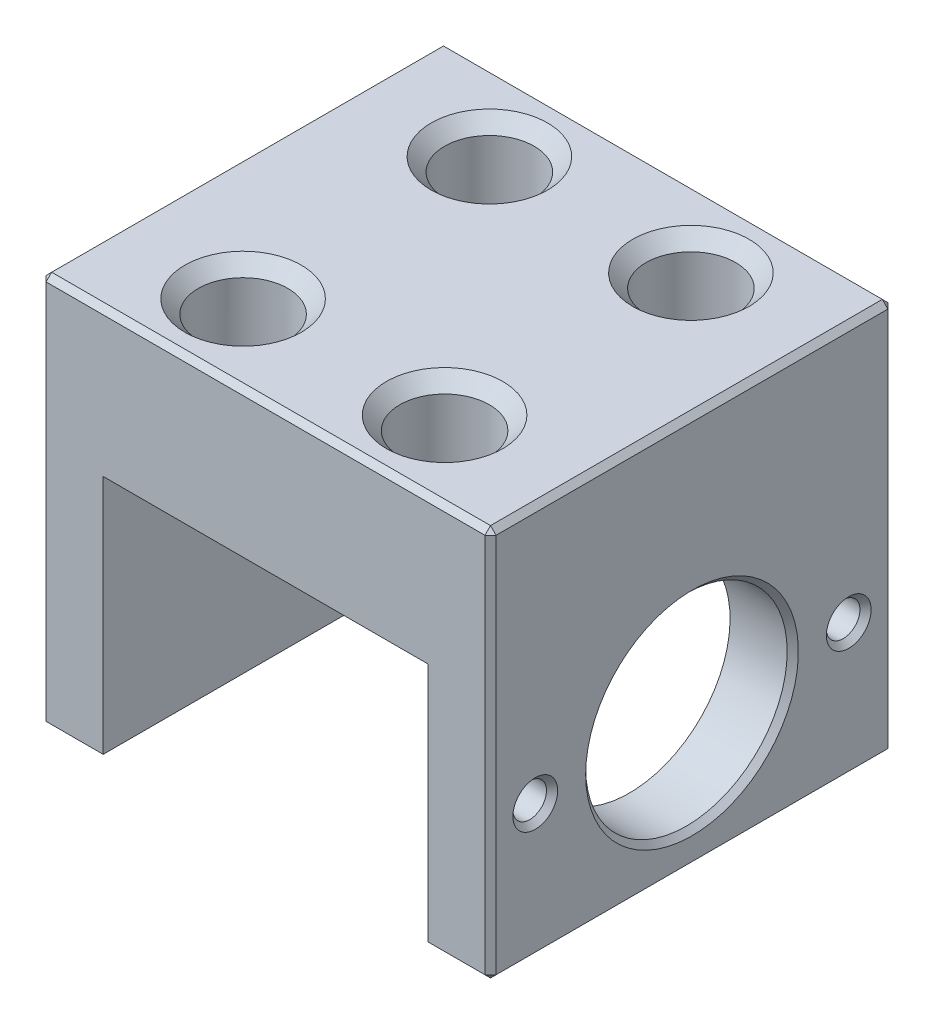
ISO-10303-21;
HEADER;
FILE_DESCRIPTION(('STEP AP214'),'2;1');
FILE_NAME('part.step','',(''),(''),'','','');
FILE_SCHEMA(('AUTOMOTIVE_DESIGN { 1 0 10303 214 1 1 1 1 }'));
ENDSEC;
DATA;
#1=APPLICATION_CONTEXT('core data for automotive mechanical design processes');
#2=APPLICATION_PROTOCOL_DEFINITION('international standard','automotive_design',2000,#1);
#3=PRODUCT_CONTEXT('',#1,'mechanical');
#4=PRODUCT('Part','Part','',(#3));
#5=PRODUCT_RELATED_PRODUCT_CATEGORY('part','',(#4));
#6=PRODUCT_DEFINITION_FORMATION('','',#4);
#7=PRODUCT_DEFINITION_CONTEXT('part definition',#1,'design');
#8=PRODUCT_DEFINITION('design','',#6,#7);
#9=PRODUCT_DEFINITION_SHAPE('','',#8);
#10=(LENGTH_UNIT() NAMED_UNIT(*) SI_UNIT(.MILLI.,.METRE.));
#11=(NAMED_UNIT(*) PLANE_ANGLE_UNIT() SI_UNIT($,.RADIAN.));
#12=(NAMED_UNIT(*) SI_UNIT($,.STERADIAN.) SOLID_ANGLE_UNIT());
#13=UNCERTAINTY_MEASURE_WITH_UNIT(LENGTH_MEASURE(1.E-05),#10,'distance_accuracy_value','');
#14=(GEOMETRIC_REPRESENTATION_CONTEXT(3) GLOBAL_UNCERTAINTY_ASSIGNED_CONTEXT((#13)) GLOBAL_UNIT_ASSIGNED_CONTEXT((#10,
#11,#12)) REPRESENTATION_CONTEXT('',''));
#15=CARTESIAN_POINT('',(0.,0.,0.));
#16=DIRECTION('',(0.,0.,1.));
#17=DIRECTION('',(1.,0.,0.));
#18=AXIS2_PLACEMENT_3D('',#15,#16,#17);
#19=CARTESIAN_POINT('',(20.1,0.,18.));
#20=DIRECTION('',(-1.,0.,0.));
#21=DIRECTION('',(0.,0.,1.));
#22=AXIS2_PLACEMENT_3D('',#19,#20,#21);
#23=PLANE('',#22);
#24=CARTESIAN_POINT('',(20.1,-23.,0.));
#25=DIRECTION('',(-1.,0.,0.));
#26=DIRECTION('',(0.,0.,1.));
#27=AXIS2_PLACEMENT_3D('',#24,#25,#26);
#28=CIRCLE('',#27,9.5);
#29=CARTESIAN_POINT('',(20.1,-23.,9.5));
#30=VERTEX_POINT('',#29);
#31=EDGE_CURVE('E208',#30,#30,#28,.T.);
#32=ORIENTED_EDGE('',*,*,#31,.T.);
#33=EDGE_LOOP('',(#32));
#34=FACE_BOUND('',#33,.T.);
#35=DIRECTION('',(0.,-1.,0.));
#36=VECTOR('',#35,1.);
#37=CARTESIAN_POINT('',(20.1,0.,17.5));
#38=LINE('',#37,#36);
#39=CARTESIAN_POINT('',(20.1,-0.5,17.5));
#40=VERTEX_POINT('',#39);
#41=CARTESIAN_POINT('',(20.1,-34.5,17.5));
#42=VERTEX_POINT('',#41);
#43=EDGE_CURVE('E199',#40,#42,#38,.T.);
#44=ORIENTED_EDGE('',*,*,#43,.T.);
#45=DIRECTION('',(0.,0.,-1.));
#46=VECTOR('',#45,1.);
#47=CARTESIAN_POINT('',(20.1,-34.5,18.));
#48=LINE('',#47,#46);
#49=CARTESIAN_POINT('',(20.1,-34.5,-17.5));
#50=VERTEX_POINT('',#49);
#51=EDGE_CURVE('E205',#42,#50,#48,.T.);
#52=ORIENTED_EDGE('',*,*,#51,.T.);
#53=DIRECTION('',(0.,1.,0.));
#54=VECTOR('',#53,1.);
#55=CARTESIAN_POINT('',(20.1,0.,-17.5));
#56=LINE('',#55,#54);
#57=CARTESIAN_POINT('',(20.1,-0.5,-17.5));
#58=VERTEX_POINT('',#57);
#59=EDGE_CURVE('E203',#50,#58,#56,.T.);
#60=ORIENTED_EDGE('',*,*,#59,.T.);
#61=DIRECTION('',(0.,0.,1.));
#62=VECTOR('',#61,1.);
#63=CARTESIAN_POINT('',(20.1,-0.5,18.));
#64=LINE('',#63,#62);
#65=EDGE_CURVE('E201',#58,#40,#64,.T.);
#66=ORIENTED_EDGE('',*,*,#65,.T.);
#67=EDGE_LOOP('',(#44,#52,#60,#66));
#68=FACE_BOUND('',#67,.T.);
#69=CARTESIAN_POINT('',(20.1,-23.,14.));
#70=DIRECTION('',(1.,0.,0.));
#71=DIRECTION('',(0.,0.,-1.));
#72=AXIS2_PLACEMENT_3D('',#69,#70,#71);
#73=CIRCLE('',#72,2.);
#74=CARTESIAN_POINT('',(20.1,-23.,12.));
#75=VERTEX_POINT('',#74);
#76=EDGE_CURVE('E715',#75,#75,#73,.T.);
#77=ORIENTED_EDGE('',*,*,#76,.F.);
#78=EDGE_LOOP('',(#77));
#79=FACE_BOUND('',#78,.T.);
#80=CARTESIAN_POINT('',(20.1,-23.,-14.));
#81=DIRECTION('',(1.,0.,0.));
#82=DIRECTION('',(0.,0.,-1.));
#83=AXIS2_PLACEMENT_3D('',#80,#81,#82);
#84=CIRCLE('',#83,2.);
#85=CARTESIAN_POINT('',(20.1,-23.,-16.));
#86=VERTEX_POINT('',#85);
#87=EDGE_CURVE('E707',#86,#86,#84,.T.);
#88=ORIENTED_EDGE('',*,*,#87,.F.);
#89=EDGE_LOOP('',(#88));
#90=FACE_BOUND('',#89,.T.);
#91=ADVANCED_FACE('F15',(#34,#68,#79,#90),#23,.F.);
#92=CARTESIAN_POINT('',(20.1,-35.,18.));
#93=DIRECTION('',(0.,1.,0.));
#94=DIRECTION('',(-1.,0.,0.));
#95=AXIS2_PLACEMENT_3D('',#92,#93,#94);
#96=PLANE('',#95);
#97=DIRECTION('',(-1.,0.,0.));
#98=VECTOR('',#97,1.);
#99=CARTESIAN_POINT('',(20.1,-35.,17.5));
#100=LINE('',#99,#98);
#101=CARTESIAN_POINT('',(19.6,-35.,17.5));
#102=VERTEX_POINT('',#101);
#103=CARTESIAN_POINT('',(15.,-35.,17.5));
#104=VERTEX_POINT('',#103);
#105=EDGE_CURVE('E213',#102,#104,#100,.T.);
#106=ORIENTED_EDGE('',*,*,#105,.T.);
#107=DIRECTION('',(0.,0.,-1.));
#108=VECTOR('',#107,1.);
#109=CARTESIAN_POINT('',(15.,-35.,18.));
#110=LINE('',#109,#108);
#111=CARTESIAN_POINT('',(15.,-35.,-17.5));
#112=VERTEX_POINT('',#111);
#113=EDGE_CURVE('E217',#104,#112,#110,.T.);
#114=ORIENTED_EDGE('',*,*,#113,.T.);
#115=DIRECTION('',(1.,0.,0.));
#116=VECTOR('',#115,1.);
#117=CARTESIAN_POINT('',(20.1,-35.,-17.5));
#118=LINE('',#117,#116);
#119=CARTESIAN_POINT('',(19.6,-35.,-17.5));
#120=VERTEX_POINT('',#119);
#121=EDGE_CURVE('E215',#112,#120,#118,.T.);
#122=ORIENTED_EDGE('',*,*,#121,.T.);
#123=DIRECTION('',(0.,0.,1.));
#124=VECTOR('',#123,1.);
#125=CARTESIAN_POINT('',(19.6,-35.,18.));
#126=LINE('',#125,#124);
#127=EDGE_CURVE('E211',#120,#102,#126,.T.);
#128=ORIENTED_EDGE('',*,*,#127,.T.);
#129=EDGE_LOOP('',(#106,#114,#122,#128));
#130=FACE_BOUND('',#129,.T.);
#131=ADVANCED_FACE('F385',(#130),#96,.F.);
#132=CARTESIAN_POINT('',(-20.1,0.,18.));
#133=DIRECTION('',(0.,-1.,0.));
#134=DIRECTION('',(1.,0.,0.));
#135=AXIS2_PLACEMENT_3D('',#132,#133,#134);
#136=PLANE('',#135);
#137=DIRECTION('',(-1.,0.,0.));
#138=VECTOR('',#137,1.);
#139=CARTESIAN_POINT('',(-20.1,0.,-17.5));
#140=LINE('',#139,#138);
#141=CARTESIAN_POINT('',(19.6,0.,-17.5));
#142=VERTEX_POINT('',#141);
#143=CARTESIAN_POINT('',(-19.6,0.,-17.5));
#144=VERTEX_POINT('',#143);
#145=EDGE_CURVE('E245',#142,#144,#140,.T.);
#146=ORIENTED_EDGE('',*,*,#145,.T.);
#147=DIRECTION('',(0.,0.,1.));
#148=VECTOR('',#147,1.);
#149=CARTESIAN_POINT('',(-19.6,0.,18.));
#150=LINE('',#149,#148);
#151=CARTESIAN_POINT('',(-19.6,0.,17.5));
#152=VERTEX_POINT('',#151);
#153=EDGE_CURVE('E249',#144,#152,#150,.T.);
#154=ORIENTED_EDGE('',*,*,#153,.T.);
#155=DIRECTION('',(1.,0.,0.));
#156=VECTOR('',#155,1.);
#157=CARTESIAN_POINT('',(-20.1,0.,17.5));
#158=LINE('',#157,#156);
#159=CARTESIAN_POINT('',(19.6,0.,17.5));
#160=VERTEX_POINT('',#159);
#161=EDGE_CURVE('E247',#152,#160,#158,.T.);
#162=ORIENTED_EDGE('',*,*,#161,.T.);
#163=DIRECTION('',(0.,0.,-1.));
#164=VECTOR('',#163,1.);
#165=CARTESIAN_POINT('',(19.6,0.,18.));
#166=LINE('',#165,#164);
#167=EDGE_CURVE('E243',#160,#142,#166,.T.);
#168=ORIENTED_EDGE('',*,*,#167,.T.);
#169=EDGE_LOOP('',(#146,#154,#162,#168));
#170=FACE_BOUND('',#169,.T.);
#171=CARTESIAN_POINT('',(9.,0.,-11.));
#172=DIRECTION('',(0.,1.,0.));
#173=DIRECTION('',(0.,0.,1.));
#174=AXIS2_PLACEMENT_3D('',#171,#172,#173);
#175=CIRCLE('',#174,5.2);
#176=CARTESIAN_POINT('',(9.,0.,-5.8));
#177=VERTEX_POINT('',#176);
#178=EDGE_CURVE('E348',#177,#177,#175,.T.);
#179=ORIENTED_EDGE('',*,*,#178,.F.);
#180=EDGE_LOOP('',(#179));
#181=FACE_BOUND('',#180,.T.);
#182=CARTESIAN_POINT('',(-9.,0.,-11.));
#183=DIRECTION('',(0.,1.,0.));
#184=DIRECTION('',(0.,0.,1.));
#185=AXIS2_PLACEMENT_3D('',#182,#183,#184);
#186=CIRCLE('',#185,5.2);
#187=CARTESIAN_POINT('',(-9.,0.,-5.8));
#188=VERTEX_POINT('',#187);
#189=EDGE_CURVE('E195',#188,#188,#186,.T.);
#190=ORIENTED_EDGE('',*,*,#189,.F.);
#191=EDGE_LOOP('',(#190));
#192=FACE_BOUND('',#191,.T.);
#193=CARTESIAN_POINT('',(-9.,0.,11.));
#194=DIRECTION('',(0.,1.,0.));
#195=DIRECTION('',(0.,0.,1.));
#196=AXIS2_PLACEMENT_3D('',#193,#194,#195);
#197=CIRCLE('',#196,5.2);
#198=CARTESIAN_POINT('',(-9.,0.,16.2));
#199=VERTEX_POINT('',#198);
#200=EDGE_CURVE('E190',#199,#199,#197,.T.);
#201=ORIENTED_EDGE('',*,*,#200,.F.);
#202=EDGE_LOOP('',(#201));
#203=FACE_BOUND('',#202,.T.);
#204=CARTESIAN_POINT('',(9.,0.,11.));
#205=DIRECTION('',(0.,1.,0.));
#206=DIRECTION('',(0.,0.,1.));
#207=AXIS2_PLACEMENT_3D('',#204,#205,#206);
#208=CIRCLE('',#207,5.2);
#209=CARTESIAN_POINT('',(9.,0.,16.2));
#210=VERTEX_POINT('',#209);
#211=EDGE_CURVE('E185',#210,#210,#208,.T.);
#212=ORIENTED_EDGE('',*,*,#211,.F.);
#213=EDGE_LOOP('',(#212));
#214=FACE_BOUND('',#213,.T.);
#215=ADVANCED_FACE('F382',(#170,#181,#192,#203,#214),#136,.F.);
#216=CARTESIAN_POINT('',(-20.1,0.,18.));
#217=DIRECTION('',(1.,0.,0.));
#218=DIRECTION('',(0.,1.,0.));
#219=AXIS2_PLACEMENT_3D('',#216,#217,#218);
#220=PLANE('',#219);
#221=DIRECTION('',(0.,1.,0.));
#222=VECTOR('',#221,1.);
#223=CARTESIAN_POINT('',(-20.1,0.,17.5));
#224=LINE('',#223,#222);
#225=CARTESIAN_POINT('',(-20.1,-34.5,17.5));
#226=VERTEX_POINT('',#225);
#227=CARTESIAN_POINT('',(-20.1,-0.5,17.5));
#228=VERTEX_POINT('',#227);
#229=EDGE_CURVE('E238',#226,#228,#224,.T.);
#230=ORIENTED_EDGE('',*,*,#229,.T.);
#231=DIRECTION('',(0.,0.,-1.));
#232=VECTOR('',#231,1.);
#233=CARTESIAN_POINT('',(-20.1,-0.5,18.));
#234=LINE('',#233,#232);
#235=CARTESIAN_POINT('',(-20.1,-0.5,-17.5));
#236=VERTEX_POINT('',#235);
#237=EDGE_CURVE('E240',#228,#236,#234,.T.);
#238=ORIENTED_EDGE('',*,*,#237,.T.);
#239=DIRECTION('',(0.,-1.,0.));
#240=VECTOR('',#239,1.);
#241=CARTESIAN_POINT('',(-20.1,-35.,-17.5));
#242=LINE('',#241,#240);
#243=CARTESIAN_POINT('',(-20.1,-34.5,-17.5));
#244=VERTEX_POINT('',#243);
#245=EDGE_CURVE('E234',#236,#244,#242,.T.);
#246=ORIENTED_EDGE('',*,*,#245,.T.);
#247=DIRECTION('',(0.,0.,1.));
#248=VECTOR('',#247,1.);
#249=CARTESIAN_POINT('',(-20.1,-34.5,18.));
#250=LINE('',#249,#248);
#251=EDGE_CURVE('E236',#244,#226,#250,.T.);
#252=ORIENTED_EDGE('',*,*,#251,.T.);
#253=EDGE_LOOP('',(#230,#238,#246,#252));
#254=FACE_BOUND('',#253,.T.);
#255=ADVANCED_FACE('F384',(#254),#220,.F.);
#256=CARTESIAN_POINT('',(-20.1,-35.,18.));
#257=DIRECTION('',(0.,1.,0.));
#258=DIRECTION('',(-1.,0.,0.));
#259=AXIS2_PLACEMENT_3D('',#256,#257,#258);
#260=PLANE('',#259);
#261=DIRECTION('',(1.,0.,0.));
#262=VECTOR('',#261,1.);
#263=CARTESIAN_POINT('',(-14.5,-35.,-17.5));
#264=LINE('',#263,#262);
#265=CARTESIAN_POINT('',(-19.6,-35.,-17.5));
#266=VERTEX_POINT('',#265);
#267=CARTESIAN_POINT('',(-15.,-35.,-17.5));
#268=VERTEX_POINT('',#267);
#269=EDGE_CURVE('E225',#266,#268,#264,.T.);
#270=ORIENTED_EDGE('',*,*,#269,.T.);
#271=DIRECTION('',(0.,0.,1.));
#272=VECTOR('',#271,1.);
#273=CARTESIAN_POINT('',(-15.,-35.,18.));
#274=LINE('',#273,#272);
#275=CARTESIAN_POINT('',(-15.,-35.,17.5));
#276=VERTEX_POINT('',#275);
#277=EDGE_CURVE('E231',#268,#276,#274,.T.);
#278=ORIENTED_EDGE('',*,*,#277,.T.);
#279=DIRECTION('',(-1.,0.,0.));
#280=VECTOR('',#279,1.);
#281=CARTESIAN_POINT('',(-20.1,-35.,17.5));
#282=LINE('',#281,#280);
#283=CARTESIAN_POINT('',(-19.6,-35.,17.5));
#284=VERTEX_POINT('',#283);
#285=EDGE_CURVE('E229',#276,#284,#282,.T.);
#286=ORIENTED_EDGE('',*,*,#285,.T.);
#287=DIRECTION('',(0.,0.,-1.));
#288=VECTOR('',#287,1.);
#289=CARTESIAN_POINT('',(-19.6,-35.,18.));
#290=LINE('',#289,#288);
#291=EDGE_CURVE('E227',#284,#266,#290,.T.);
#292=ORIENTED_EDGE('',*,*,#291,.T.);
#293=EDGE_LOOP('',(#270,#278,#286,#292));
#294=FACE_BOUND('',#293,.T.);
#295=ADVANCED_FACE('F394',(#294),#260,.F.);
#296=CARTESIAN_POINT('',(-14.5,-35.,18.));
#297=DIRECTION('',(-1.,0.,0.));
#298=DIRECTION('',(0.,-1.,0.));
#299=AXIS2_PLACEMENT_3D('',#296,#297,#298);
#300=PLANE('',#299);
#301=DIRECTION('',(0.,1.,0.));
#302=VECTOR('',#301,1.);
#303=CARTESIAN_POINT('',(-14.5,-35.,18.));
#304=LINE('',#303,#302);
#305=CARTESIAN_POINT('',(-14.5,-34.5,18.));
#306=VERTEX_POINT('',#305);
#307=CARTESIAN_POINT('',(-14.5,-13.,18.));
#308=VERTEX_POINT('',#307);
#309=EDGE_CURVE('E139',#306,#308,#304,.T.);
#310=ORIENTED_EDGE('',*,*,#309,.F.);
#311=DIRECTION('',(0.,0.,-1.));
#312=VECTOR('',#311,1.);
#313=CARTESIAN_POINT('',(-14.5,-34.5,18.));
#314=LINE('',#313,#312);
#315=CARTESIAN_POINT('',(-14.5,-34.5,-18.));
#316=VERTEX_POINT('',#315);
#317=EDGE_CURVE('E223',#306,#316,#314,.T.);
#318=ORIENTED_EDGE('',*,*,#317,.T.);
#319=DIRECTION('',(0.,1.,0.));
#320=VECTOR('',#319,1.);
#321=CARTESIAN_POINT('',(-14.5,-35.,-18.));
#322=LINE('',#321,#320);
#323=CARTESIAN_POINT('',(-14.5,-13.,-18.));
#324=VERTEX_POINT('',#323);
#325=EDGE_CURVE('E155',#316,#324,#322,.T.);
#326=ORIENTED_EDGE('',*,*,#325,.T.);
#327=DIRECTION('',(0.,0.,-1.));
#328=VECTOR('',#327,1.);
#329=CARTESIAN_POINT('',(-14.5,-13.,18.));
#330=LINE('',#329,#328);
#331=EDGE_CURVE('E153',#308,#324,#330,.T.);
#332=ORIENTED_EDGE('',*,*,#331,.F.);
#333=EDGE_LOOP('',(#310,#318,#326,#332));
#334=FACE_BOUND('',#333,.T.);
#335=ADVANCED_FACE('F154',(#334),#300,.F.);
#336=CARTESIAN_POINT('',(14.5,-13.,18.));
#337=DIRECTION('',(0.,1.,0.));
#338=DIRECTION('',(-1.,0.,0.));
#339=AXIS2_PLACEMENT_3D('',#336,#337,#338);
#340=PLANE('',#339);
#341=CARTESIAN_POINT('',(9.,-13.,-11.));
#342=DIRECTION('',(0.,1.,0.));
#343=DIRECTION('',(-1.,0.,0.));
#344=AXIS2_PLACEMENT_3D('',#341,#342,#343);
#345=CIRCLE('',#344,4.);
#346=CARTESIAN_POINT('',(5.,-13.,-11.));
#347=VERTEX_POINT('',#346);
#348=EDGE_CURVE('E192',#347,#347,#345,.T.);
#349=ORIENTED_EDGE('',*,*,#348,.T.);
#350=EDGE_LOOP('',(#349));
#351=FACE_BOUND('',#350,.T.);
#352=CARTESIAN_POINT('',(-9.,-13.,-11.));
#353=DIRECTION('',(0.,1.,0.));
#354=DIRECTION('',(-1.,0.,0.));
#355=AXIS2_PLACEMENT_3D('',#352,#353,#354);
#356=CIRCLE('',#355,4.);
#357=CARTESIAN_POINT('',(-13.,-13.,-11.));
#358=VERTEX_POINT('',#357);
#359=EDGE_CURVE('E187',#358,#358,#356,.T.);
#360=ORIENTED_EDGE('',*,*,#359,.T.);
#361=EDGE_LOOP('',(#360));
#362=FACE_BOUND('',#361,.T.);
#363=CARTESIAN_POINT('',(-9.,-13.,11.));
#364=DIRECTION('',(0.,1.,0.));
#365=DIRECTION('',(-1.,0.,0.));
#366=AXIS2_PLACEMENT_3D('',#363,#364,#365);
#367=CIRCLE('',#366,4.);
#368=CARTESIAN_POINT('',(-13.,-13.,11.));
#369=VERTEX_POINT('',#368);
#370=EDGE_CURVE('E182',#369,#369,#367,.T.);
#371=ORIENTED_EDGE('',*,*,#370,.T.);
#372=EDGE_LOOP('',(#371));
#373=FACE_BOUND('',#372,.T.);
#374=CARTESIAN_POINT('',(9.,-13.,11.));
#375=DIRECTION('',(0.,1.,0.));
#376=DIRECTION('',(-1.,0.,0.));
#377=AXIS2_PLACEMENT_3D('',#374,#375,#376);
#378=CIRCLE('',#377,4.);
#379=CARTESIAN_POINT('',(5.,-13.,11.));
#380=VERTEX_POINT('',#379);
#381=EDGE_CURVE('E178',#380,#380,#378,.T.);
#382=ORIENTED_EDGE('',*,*,#381,.T.);
#383=EDGE_LOOP('',(#382));
#384=FACE_BOUND('',#383,.T.);
#385=DIRECTION('',(1.,0.,0.));
#386=VECTOR('',#385,1.);
#387=CARTESIAN_POINT('',(14.5,-13.,-18.));
#388=LINE('',#387,#386);
#389=CARTESIAN_POINT('',(14.5,-13.,-18.));
#390=VERTEX_POINT('',#389);
#391=EDGE_CURVE('E170',#324,#390,#388,.T.);
#392=ORIENTED_EDGE('',*,*,#391,.T.);
#393=DIRECTION('',(0.,0.,-1.));
#394=VECTOR('',#393,1.);
#395=CARTESIAN_POINT('',(14.5,-13.,18.));
#396=LINE('',#395,#394);
#397=CARTESIAN_POINT('',(14.5,-13.,18.));
#398=VERTEX_POINT('',#397);
#399=EDGE_CURVE('E159',#398,#390,#396,.T.);
#400=ORIENTED_EDGE('',*,*,#399,.F.);
#401=DIRECTION('',(1.,0.,0.));
#402=VECTOR('',#401,1.);
#403=CARTESIAN_POINT('',(14.5,-13.,18.));
#404=LINE('',#403,#402);
#405=EDGE_CURVE('E144',#308,#398,#404,.T.);
#406=ORIENTED_EDGE('',*,*,#405,.F.);
#407=ORIENTED_EDGE('',*,*,#331,.T.);
#408=EDGE_LOOP('',(#392,#400,#406,#407));
#409=FACE_BOUND('',#408,.T.);
#410=ADVANCED_FACE('F161',(#351,#362,#373,#384,#409),#340,.F.);
#411=CARTESIAN_POINT('',(14.5,-35.,18.));
#412=DIRECTION('',(1.,0.,0.));
#413=DIRECTION('',(0.,1.,0.));
#414=AXIS2_PLACEMENT_3D('',#411,#412,#413);
#415=PLANE('',#414);
#416=CARTESIAN_POINT('',(14.5,-23.,-14.));
#417=DIRECTION('',(1.,0.,0.));
#418=DIRECTION('',(0.,1.,0.));
#419=AXIS2_PLACEMENT_3D('',#416,#417,#418);
#420=CIRCLE('',#419,1.5);
#421=CARTESIAN_POINT('',(14.5,-21.5,-14.));
#422=VERTEX_POINT('',#421);
#423=EDGE_CURVE('E710',#422,#422,#420,.T.);
#424=ORIENTED_EDGE('',*,*,#423,.T.);
#425=EDGE_LOOP('',(#424));
#426=FACE_BOUND('',#425,.T.);
#427=CARTESIAN_POINT('',(14.5,-23.,14.));
#428=DIRECTION('',(1.,0.,0.));
#429=DIRECTION('',(0.,1.,0.));
#430=AXIS2_PLACEMENT_3D('',#427,#428,#429);
#431=CIRCLE('',#430,1.5);
#432=CARTESIAN_POINT('',(14.5,-21.5,14.));
#433=VERTEX_POINT('',#432);
#434=EDGE_CURVE('E271',#433,#433,#431,.T.);
#435=ORIENTED_EDGE('',*,*,#434,.T.);
#436=EDGE_LOOP('',(#435));
#437=FACE_BOUND('',#436,.T.);
#438=CARTESIAN_POINT('',(14.5,-23.,0.));
#439=DIRECTION('',(1.,0.,0.));
#440=DIRECTION('',(0.,1.,0.));
#441=AXIS2_PLACEMENT_3D('',#438,#439,#440);
#442=CIRCLE('',#441,9.);
#443=CARTESIAN_POINT('',(14.5,-14.,0.));
#444=VERTEX_POINT('',#443);
#445=EDGE_CURVE('E171',#444,#444,#442,.T.);
#446=ORIENTED_EDGE('',*,*,#445,.T.);
#447=EDGE_LOOP('',(#446));
#448=FACE_BOUND('',#447,.T.);
#449=DIRECTION('',(0.,-1.,0.));
#450=VECTOR('',#449,1.);
#451=CARTESIAN_POINT('',(14.5,-35.,-18.));
#452=LINE('',#451,#450);
#453=CARTESIAN_POINT('',(14.5,-34.5,-18.));
#454=VERTEX_POINT('',#453);
#455=EDGE_CURVE('E150',#390,#454,#452,.T.);
#456=ORIENTED_EDGE('',*,*,#455,.T.);
#457=DIRECTION('',(0.,0.,1.));
#458=VECTOR('',#457,1.);
#459=CARTESIAN_POINT('',(14.5,-34.5,18.));
#460=LINE('',#459,#458);
#461=CARTESIAN_POINT('',(14.5,-34.5,18.));
#462=VERTEX_POINT('',#461);
#463=EDGE_CURVE('E220',#454,#462,#460,.T.);
#464=ORIENTED_EDGE('',*,*,#463,.T.);
#465=DIRECTION('',(0.,-1.,0.));
#466=VECTOR('',#465,1.);
#467=CARTESIAN_POINT('',(14.5,-35.,18.));
#468=LINE('',#467,#466);
#469=EDGE_CURVE('E164',#398,#462,#468,.T.);
#470=ORIENTED_EDGE('',*,*,#469,.F.);
#471=ORIENTED_EDGE('',*,*,#399,.T.);
#472=EDGE_LOOP('',(#456,#464,#470,#471));
#473=FACE_BOUND('',#472,.T.);
#474=ADVANCED_FACE('F608',(#426,#437,#448,#473),#415,.F.);
#475=CARTESIAN_POINT('',(0.,0.,18.));
#476=DIRECTION('',(0.,0.,-1.));
#477=DIRECTION('',(-1.,0.,0.));
#478=AXIS2_PLACEMENT_3D('',#475,#476,#477);
#479=PLANE('',#478);
#480=DIRECTION('',(0.,-1.,0.));
#481=VECTOR('',#480,1.);
#482=CARTESIAN_POINT('',(-19.6,0.,18.));
#483=LINE('',#482,#481);
#484=CARTESIAN_POINT('',(-19.6,-0.5,18.));
#485=VERTEX_POINT('',#484);
#486=CARTESIAN_POINT('',(-19.6,-34.5,18.));
#487=VERTEX_POINT('',#486);
#488=EDGE_CURVE('E258',#485,#487,#483,.T.);
#489=ORIENTED_EDGE('',*,*,#488,.T.);
#490=DIRECTION('',(1.,0.,0.));
#491=VECTOR('',#490,1.);
#492=CARTESIAN_POINT('',(0.,-34.5,18.));
#493=LINE('',#492,#491);
#494=EDGE_CURVE('E147',#487,#306,#493,.T.);
#495=ORIENTED_EDGE('',*,*,#494,.T.);
#496=ORIENTED_EDGE('',*,*,#309,.T.);
#497=ORIENTED_EDGE('',*,*,#405,.T.);
#498=ORIENTED_EDGE('',*,*,#469,.T.);
#499=DIRECTION('',(1.,0.,0.));
#500=VECTOR('',#499,1.);
#501=CARTESIAN_POINT('',(0.,-34.5,18.));
#502=LINE('',#501,#500);
#503=CARTESIAN_POINT('',(19.6,-34.5,18.));
#504=VERTEX_POINT('',#503);
#505=EDGE_CURVE('E254',#462,#504,#502,.T.);
#506=ORIENTED_EDGE('',*,*,#505,.T.);
#507=DIRECTION('',(0.,1.,0.));
#508=VECTOR('',#507,1.);
#509=CARTESIAN_POINT('',(19.6,0.,18.));
#510=LINE('',#509,#508);
#511=CARTESIAN_POINT('',(19.6,-0.5,18.));
#512=VERTEX_POINT('',#511);
#513=EDGE_CURVE('E252',#504,#512,#510,.T.);
#514=ORIENTED_EDGE('',*,*,#513,.T.);
#515=DIRECTION('',(-1.,0.,0.));
#516=VECTOR('',#515,1.);
#517=CARTESIAN_POINT('',(0.,-0.5,18.));
#518=LINE('',#517,#516);
#519=EDGE_CURVE('E256',#512,#485,#518,.T.);
#520=ORIENTED_EDGE('',*,*,#519,.T.);
#521=EDGE_LOOP('',(#489,#495,#496,#497,#498,#506,#514,#520));
#522=FACE_BOUND('',#521,.T.);
#523=ADVANCED_FACE('F141',(#522),#479,.F.);
#524=CARTESIAN_POINT('',(0.,0.,-18.));
#525=DIRECTION('',(0.,0.,-1.));
#526=DIRECTION('',(-1.,0.,0.));
#527=AXIS2_PLACEMENT_3D('',#524,#525,#526);
#528=PLANE('',#527);
#529=ORIENTED_EDGE('',*,*,#325,.F.);
#530=DIRECTION('',(-1.,0.,0.));
#531=VECTOR('',#530,1.);
#532=CARTESIAN_POINT('',(-20.1,-34.5,-18.));
#533=LINE('',#532,#531);
#534=CARTESIAN_POINT('',(-19.6,-34.5,-18.));
#535=VERTEX_POINT('',#534);
#536=EDGE_CURVE('E9',#316,#535,#533,.T.);
#537=ORIENTED_EDGE('',*,*,#536,.T.);
#538=DIRECTION('',(0.,1.,0.));
#539=VECTOR('',#538,1.);
#540=CARTESIAN_POINT('',(-19.6,0.,-18.));
#541=LINE('',#540,#539);
#542=CARTESIAN_POINT('',(-19.6,-0.500000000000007,-18.));
#543=VERTEX_POINT('',#542);
#544=EDGE_CURVE('E25',#535,#543,#541,.T.);
#545=ORIENTED_EDGE('',*,*,#544,.T.);
#546=DIRECTION('',(1.,0.,0.));
#547=VECTOR('',#546,1.);
#548=CARTESIAN_POINT('',(20.1,-0.5,-18.));
#549=LINE('',#548,#547);
#550=CARTESIAN_POINT('',(19.6,-0.5,-18.));
#551=VERTEX_POINT('',#550);
#552=EDGE_CURVE('E265',#543,#551,#549,.T.);
#553=ORIENTED_EDGE('',*,*,#552,.T.);
#554=DIRECTION('',(0.,-1.,0.));
#555=VECTOR('',#554,1.);
#556=CARTESIAN_POINT('',(19.6,-35.,-18.));
#557=LINE('',#556,#555);
#558=CARTESIAN_POINT('',(19.6,-34.5,-18.));
#559=VERTEX_POINT('',#558);
#560=EDGE_CURVE('E261',#551,#559,#557,.T.);
#561=ORIENTED_EDGE('',*,*,#560,.T.);
#562=DIRECTION('',(-1.,0.,0.));
#563=VECTOR('',#562,1.);
#564=CARTESIAN_POINT('',(14.5,-34.5,-18.));
#565=LINE('',#564,#563);
#566=EDGE_CURVE('E263',#559,#454,#565,.T.);
#567=ORIENTED_EDGE('',*,*,#566,.T.);
#568=ORIENTED_EDGE('',*,*,#455,.F.);
#569=ORIENTED_EDGE('',*,*,#391,.F.);
#570=EDGE_LOOP('',(#529,#537,#545,#553,#561,#567,#568,#569));
#571=FACE_BOUND('',#570,.T.);
#572=ADVANCED_FACE('F593',(#571),#528,.T.);
#573=CARTESIAN_POINT('',(11.1,-23.,0.));
#574=DIRECTION('',(1.,0.,0.));
#575=DIRECTION('',(0.,1.,0.));
#576=AXIS2_PLACEMENT_3D('',#573,#574,#575);
#577=CYLINDRICAL_SURFACE('',#576,9.);
#578=CARTESIAN_POINT('',(19.6,-23.,0.));
#579=DIRECTION('',(-1.,0.,0.));
#580=DIRECTION('',(0.,0.,1.));
#581=AXIS2_PLACEMENT_3D('',#578,#579,#580);
#582=CIRCLE('',#581,9.);
#583=CARTESIAN_POINT('',(19.6,-23.,9.));
#584=VERTEX_POINT('',#583);
#585=EDGE_CURVE('E158',#584,#584,#582,.F.);
#586=ORIENTED_EDGE('',*,*,#585,.T.);
#587=EDGE_LOOP('',(#586));
#588=FACE_BOUND('',#587,.T.);
#589=ORIENTED_EDGE('',*,*,#445,.F.);
#590=EDGE_LOOP('',(#589));
#591=FACE_BOUND('',#590,.T.);
#592=ADVANCED_FACE('F654',(#588,#591),#577,.F.);
#593=CARTESIAN_POINT('',(9.,0.,11.));
#594=DIRECTION('',(0.,1.,0.));
#595=DIRECTION('',(0.,0.,1.));
#596=AXIS2_PLACEMENT_3D('',#593,#594,#595);
#597=CYLINDRICAL_SURFACE('',#596,4.);
#598=CARTESIAN_POINT('',(9.,-1.2,11.));
#599=DIRECTION('',(0.,1.,0.));
#600=DIRECTION('',(0.,0.,1.));
#601=AXIS2_PLACEMENT_3D('',#598,#599,#600);
#602=CIRCLE('',#601,4.);
#603=CARTESIAN_POINT('',(9.,-1.2,15.));
#604=VERTEX_POINT('',#603);
#605=EDGE_CURVE('E181',#604,#604,#602,.T.);
#606=ORIENTED_EDGE('',*,*,#605,.T.);
#607=EDGE_LOOP('',(#606));
#608=FACE_BOUND('',#607,.T.);
#609=ORIENTED_EDGE('',*,*,#381,.F.);
#610=EDGE_LOOP('',(#609));
#611=FACE_BOUND('',#610,.T.);
#612=ADVANCED_FACE('F372',(#608,#611),#597,.F.);
#613=CARTESIAN_POINT('',(9.,0.,11.));
#614=DIRECTION('',(0.,1.,0.));
#615=DIRECTION('',(0.,0.,1.));
#616=AXIS2_PLACEMENT_3D('',#613,#614,#615);
#617=CONICAL_SURFACE('',#616,5.2,0.785398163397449);
#618=ORIENTED_EDGE('',*,*,#605,.F.);
#619=EDGE_LOOP('',(#618));
#620=FACE_BOUND('',#619,.T.);
#621=ORIENTED_EDGE('',*,*,#211,.T.);
#622=EDGE_LOOP('',(#621));
#623=FACE_BOUND('',#622,.T.);
#624=ADVANCED_FACE('F375',(#620,#623),#617,.F.);
#625=CARTESIAN_POINT('',(-9.,0.,11.));
#626=DIRECTION('',(0.,1.,0.));
#627=DIRECTION('',(0.,0.,1.));
#628=AXIS2_PLACEMENT_3D('',#625,#626,#627);
#629=CYLINDRICAL_SURFACE('',#628,4.);
#630=CARTESIAN_POINT('',(-9.,-1.2,11.));
#631=DIRECTION('',(0.,1.,0.));
#632=DIRECTION('',(0.,0.,1.));
#633=AXIS2_PLACEMENT_3D('',#630,#631,#632);
#634=CIRCLE('',#633,4.);
#635=CARTESIAN_POINT('',(-9.,-1.2,15.));
#636=VERTEX_POINT('',#635);
#637=EDGE_CURVE('E186',#636,#636,#634,.T.);
#638=ORIENTED_EDGE('',*,*,#637,.T.);
#639=EDGE_LOOP('',(#638));
#640=FACE_BOUND('',#639,.T.);
#641=ORIENTED_EDGE('',*,*,#370,.F.);
#642=EDGE_LOOP('',(#641));
#643=FACE_BOUND('',#642,.T.);
#644=ADVANCED_FACE('F378',(#640,#643),#629,.F.);
#645=CARTESIAN_POINT('',(-9.,0.,11.));
#646=DIRECTION('',(0.,1.,0.));
#647=DIRECTION('',(0.,0.,1.));
#648=AXIS2_PLACEMENT_3D('',#645,#646,#647);
#649=CONICAL_SURFACE('',#648,5.2,0.785398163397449);
#650=ORIENTED_EDGE('',*,*,#637,.F.);
#651=EDGE_LOOP('',(#650));
#652=FACE_BOUND('',#651,.T.);
#653=ORIENTED_EDGE('',*,*,#200,.T.);
#654=EDGE_LOOP('',(#653));
#655=FACE_BOUND('',#654,.T.);
#656=ADVANCED_FACE('F664',(#652,#655),#649,.F.);
#657=CARTESIAN_POINT('',(-9.,0.,-11.));
#658=DIRECTION('',(0.,1.,0.));
#659=DIRECTION('',(0.,0.,1.));
#660=AXIS2_PLACEMENT_3D('',#657,#658,#659);
#661=CYLINDRICAL_SURFACE('',#660,4.);
#662=CARTESIAN_POINT('',(-9.,-1.2,-11.));
#663=DIRECTION('',(0.,1.,0.));
#664=DIRECTION('',(0.,0.,1.));
#665=AXIS2_PLACEMENT_3D('',#662,#663,#664);
#666=CIRCLE('',#665,4.);
#667=CARTESIAN_POINT('',(-9.,-1.2,-7.));
#668=VERTEX_POINT('',#667);
#669=EDGE_CURVE('E191',#668,#668,#666,.T.);
#670=ORIENTED_EDGE('',*,*,#669,.T.);
#671=EDGE_LOOP('',(#670));
#672=FACE_BOUND('',#671,.T.);
#673=ORIENTED_EDGE('',*,*,#359,.F.);
#674=EDGE_LOOP('',(#673));
#675=FACE_BOUND('',#674,.T.);
#676=ADVANCED_FACE('F668',(#672,#675),#661,.F.);
#677=CARTESIAN_POINT('',(-9.,0.,-11.));
#678=DIRECTION('',(0.,1.,0.));
#679=DIRECTION('',(0.,0.,1.));
#680=AXIS2_PLACEMENT_3D('',#677,#678,#679);
#681=CONICAL_SURFACE('',#680,5.2,0.785398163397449);
#682=ORIENTED_EDGE('',*,*,#669,.F.);
#683=EDGE_LOOP('',(#682));
#684=FACE_BOUND('',#683,.T.);
#685=ORIENTED_EDGE('',*,*,#189,.T.);
#686=EDGE_LOOP('',(#685));
#687=FACE_BOUND('',#686,.T.);
#688=ADVANCED_FACE('F672',(#684,#687),#681,.F.);
#689=CARTESIAN_POINT('',(9.,0.,-11.));
#690=DIRECTION('',(0.,1.,0.));
#691=DIRECTION('',(0.,0.,1.));
#692=AXIS2_PLACEMENT_3D('',#689,#690,#691);
#693=CYLINDRICAL_SURFACE('',#692,4.);
#694=CARTESIAN_POINT('',(9.,-1.2,-11.));
#695=DIRECTION('',(0.,1.,0.));
#696=DIRECTION('',(0.,0.,1.));
#697=AXIS2_PLACEMENT_3D('',#694,#695,#696);
#698=CIRCLE('',#697,4.);
#699=CARTESIAN_POINT('',(9.,-1.2,-7.));
#700=VERTEX_POINT('',#699);
#701=EDGE_CURVE('E196',#700,#700,#698,.T.);
#702=ORIENTED_EDGE('',*,*,#701,.T.);
#703=EDGE_LOOP('',(#702));
#704=FACE_BOUND('',#703,.T.);
#705=ORIENTED_EDGE('',*,*,#348,.F.);
#706=EDGE_LOOP('',(#705));
#707=FACE_BOUND('',#706,.T.);
#708=ADVANCED_FACE('F676',(#704,#707),#693,.F.);
#709=CARTESIAN_POINT('',(9.,0.,-11.));
#710=DIRECTION('',(0.,1.,0.));
#711=DIRECTION('',(0.,0.,1.));
#712=AXIS2_PLACEMENT_3D('',#709,#710,#711);
#713=CONICAL_SURFACE('',#712,5.2,0.78539816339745);
#714=ORIENTED_EDGE('',*,*,#701,.F.);
#715=EDGE_LOOP('',(#714));
#716=FACE_BOUND('',#715,.T.);
#717=ORIENTED_EDGE('',*,*,#178,.T.);
#718=EDGE_LOOP('',(#717));
#719=FACE_BOUND('',#718,.T.);
#720=ADVANCED_FACE('F415',(#716,#719),#713,.F.);
#721=CARTESIAN_POINT('',(19.6,-23.,0.));
#722=DIRECTION('',(1.,0.,0.));
#723=DIRECTION('',(0.,0.,-1.));
#724=AXIS2_PLACEMENT_3D('',#721,#722,#723);
#725=CONICAL_SURFACE('',#724,9.,0.785398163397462);
#726=ORIENTED_EDGE('',*,*,#31,.F.);
#727=EDGE_LOOP('',(#726));
#728=FACE_BOUND('',#727,.T.);
#729=ORIENTED_EDGE('',*,*,#585,.F.);
#730=EDGE_LOOP('',(#729));
#731=FACE_BOUND('',#730,.T.);
#732=ADVANCED_FACE('F409',(#728,#731),#725,.F.);
#733=CARTESIAN_POINT('',(-14.5,-34.5,18.));
#734=DIRECTION('',(-0.707106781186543,0.707106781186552,0.));
#735=DIRECTION('',(0.,0.,-1.));
#736=AXIS2_PLACEMENT_3D('',#733,#734,#735);
#737=PLANE('',#736);
#738=DIRECTION('',(0.577350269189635,0.577350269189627,-0.577350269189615));
#739=VECTOR('',#738,1.);
#740=CARTESIAN_POINT('',(-16.7,-36.7,-15.8));
#741=LINE('',#740,#739);
#742=EDGE_CURVE('E342',#316,#268,#741,.F.);
#743=ORIENTED_EDGE('',*,*,#742,.F.);
#744=ORIENTED_EDGE('',*,*,#317,.F.);
#745=DIRECTION('',(0.577350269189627,0.577350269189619,0.577350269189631));
#746=VECTOR('',#745,1.);
#747=CARTESIAN_POINT('',(-9.66666666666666,-29.6666666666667,22.8333333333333));
#748=LINE('',#747,#746);
#749=EDGE_CURVE('E20',#276,#306,#748,.T.);
#750=ORIENTED_EDGE('',*,*,#749,.F.);
#751=ORIENTED_EDGE('',*,*,#277,.F.);
#752=EDGE_LOOP('',(#743,#744,#750,#751));
#753=FACE_BOUND('',#752,.T.);
#754=ADVANCED_FACE('F18',(#753),#737,.F.);
#755=CARTESIAN_POINT('',(0.,-34.5,18.));
#756=DIRECTION('',(0.,0.707106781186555,-0.707106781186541));
#757=DIRECTION('',(1.,0.,0.));
#758=AXIS2_PLACEMENT_3D('',#755,#756,#757);
#759=PLANE('',#758);
#760=ORIENTED_EDGE('',*,*,#749,.T.);
#761=ORIENTED_EDGE('',*,*,#494,.F.);
#762=DIRECTION('',(0.,-0.707106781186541,-0.707106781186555));
#763=VECTOR('',#762,1.);
#764=CARTESIAN_POINT('',(-19.6,-34.5,18.));
#765=LINE('',#764,#763);
#766=EDGE_CURVE('E340',#284,#487,#765,.F.);
#767=ORIENTED_EDGE('',*,*,#766,.F.);
#768=ORIENTED_EDGE('',*,*,#285,.F.);
#769=EDGE_LOOP('',(#760,#761,#767,#768));
#770=FACE_BOUND('',#769,.T.);
#771=ADVANCED_FACE('F570',(#770),#759,.F.);
#772=CARTESIAN_POINT('',(-19.6,-35.,18.));
#773=DIRECTION('',(0.707106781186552,0.707106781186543,0.));
#774=DIRECTION('',(0.,0.,-1.));
#775=AXIS2_PLACEMENT_3D('',#772,#773,#774);
#776=PLANE('',#775);
#777=DIRECTION('',(0.707106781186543,-0.707106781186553,0.));
#778=VECTOR('',#777,1.);
#779=CARTESIAN_POINT('',(-19.6,-35.,-17.5));
#780=LINE('',#779,#778);
#781=EDGE_CURVE('E334',#266,#244,#780,.F.);
#782=ORIENTED_EDGE('',*,*,#781,.F.);
#783=ORIENTED_EDGE('',*,*,#291,.F.);
#784=DIRECTION('',(-0.707106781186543,0.707106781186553,0.));
#785=VECTOR('',#784,1.);
#786=CARTESIAN_POINT('',(-19.85,-34.75,17.5));
#787=LINE('',#786,#785);
#788=EDGE_CURVE('E337',#226,#284,#787,.F.);
#789=ORIENTED_EDGE('',*,*,#788,.F.);
#790=ORIENTED_EDGE('',*,*,#251,.F.);
#791=EDGE_LOOP('',(#782,#783,#789,#790));
#792=FACE_BOUND('',#791,.T.);
#793=ADVANCED_FACE('F565',(#792),#776,.F.);
#794=CARTESIAN_POINT('',(-20.1,-35.,-17.5));
#795=DIRECTION('',(0.,-0.70710678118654,-0.707106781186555));
#796=DIRECTION('',(-1.,0.,0.));
#797=AXIS2_PLACEMENT_3D('',#794,#795,#796);
#798=PLANE('',#797);
#799=ORIENTED_EDGE('',*,*,#742,.T.);
#800=ORIENTED_EDGE('',*,*,#269,.F.);
#801=DIRECTION('',(0.,-0.707106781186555,0.70710678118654));
#802=VECTOR('',#801,1.);
#803=CARTESIAN_POINT('',(-19.6,-35.,-17.5));
#804=LINE('',#803,#802);
#805=EDGE_CURVE('E331',#535,#266,#804,.T.);
#806=ORIENTED_EDGE('',*,*,#805,.F.);
#807=ORIENTED_EDGE('',*,*,#536,.F.);
#808=EDGE_LOOP('',(#799,#800,#806,#807));
#809=FACE_BOUND('',#808,.T.);
#810=ADVANCED_FACE('F558',(#809),#798,.T.);
#811=CARTESIAN_POINT('',(-19.6,-34.5,18.));
#812=DIRECTION('',(-0.577350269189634,-0.577350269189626,0.577350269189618));
#813=DIRECTION('',(0.707106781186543,-0.707106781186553,0.));
#814=AXIS2_PLACEMENT_3D('',#811,#812,#813);
#815=PLANE('',#814);
#816=ORIENTED_EDGE('',*,*,#788,.T.);
#817=ORIENTED_EDGE('',*,*,#766,.T.);
#818=DIRECTION('',(0.707106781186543,0.,0.707106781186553));
#819=VECTOR('',#818,1.);
#820=CARTESIAN_POINT('',(-19.6,-34.5,18.));
#821=LINE('',#820,#819);
#822=EDGE_CURVE('E328',#226,#487,#821,.T.);
#823=ORIENTED_EDGE('',*,*,#822,.F.);
#824=EDGE_LOOP('',(#816,#817,#823));
#825=FACE_BOUND('',#824,.T.);
#826=ADVANCED_FACE('F551',(#825),#815,.T.);
#827=CARTESIAN_POINT('',(-19.6,-35.,-17.5));
#828=DIRECTION('',(-0.577350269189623,-0.577350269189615,-0.577350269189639));
#829=DIRECTION('',(-0.707106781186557,0.,0.707106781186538));
#830=AXIS2_PLACEMENT_3D('',#827,#828,#829);
#831=PLANE('',#830);
#832=ORIENTED_EDGE('',*,*,#805,.T.);
#833=ORIENTED_EDGE('',*,*,#781,.T.);
#834=DIRECTION('',(0.707106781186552,0.,-0.707106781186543));
#835=VECTOR('',#834,1.);
#836=CARTESIAN_POINT('',(-19.85,-34.5,-17.75));
#837=LINE('',#836,#835);
#838=EDGE_CURVE('E325',#535,#244,#837,.F.);
#839=ORIENTED_EDGE('',*,*,#838,.F.);
#840=EDGE_LOOP('',(#832,#833,#839));
#841=FACE_BOUND('',#840,.T.);
#842=ADVANCED_FACE('F544',(#841),#831,.T.);
#843=CARTESIAN_POINT('',(-19.6,0.,18.));
#844=DIRECTION('',(0.707106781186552,0.,-0.707106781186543));
#845=DIRECTION('',(0.,-1.,0.));
#846=AXIS2_PLACEMENT_3D('',#843,#844,#845);
#847=PLANE('',#846);
#848=ORIENTED_EDGE('',*,*,#822,.T.);
#849=ORIENTED_EDGE('',*,*,#488,.F.);
#850=DIRECTION('',(-0.707106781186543,0.,-0.707106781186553));
#851=VECTOR('',#850,1.);
#852=CARTESIAN_POINT('',(-19.85,-0.5,17.75));
#853=LINE('',#852,#851);
#854=EDGE_CURVE('E322',#228,#485,#853,.F.);
#855=ORIENTED_EDGE('',*,*,#854,.F.);
#856=ORIENTED_EDGE('',*,*,#229,.F.);
#857=EDGE_LOOP('',(#848,#849,#855,#856));
#858=FACE_BOUND('',#857,.T.);
#859=ADVANCED_FACE('F537',(#858),#847,.F.);
#860=CARTESIAN_POINT('',(-20.1,-0.5,18.));
#861=DIRECTION('',(0.707106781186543,-0.707106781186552,0.));
#862=DIRECTION('',(0.,0.,-1.));
#863=AXIS2_PLACEMENT_3D('',#860,#861,#862);
#864=PLANE('',#863);
#865=DIRECTION('',(-0.707106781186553,-0.707106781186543,0.));
#866=VECTOR('',#865,1.);
#867=CARTESIAN_POINT('',(-20.1,-0.5,-17.5));
#868=LINE('',#867,#866);
#869=EDGE_CURVE('E316',#236,#144,#868,.F.);
#870=ORIENTED_EDGE('',*,*,#869,.F.);
#871=ORIENTED_EDGE('',*,*,#237,.F.);
#872=DIRECTION('',(0.707106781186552,0.707106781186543,0.));
#873=VECTOR('',#872,1.);
#874=CARTESIAN_POINT('',(-19.6,0.,17.5));
#875=LINE('',#874,#873);
#876=EDGE_CURVE('E319',#152,#228,#875,.F.);
#877=ORIENTED_EDGE('',*,*,#876,.F.);
#878=ORIENTED_EDGE('',*,*,#153,.F.);
#879=EDGE_LOOP('',(#870,#871,#877,#878));
#880=FACE_BOUND('',#879,.T.);
#881=ADVANCED_FACE('F530',(#880),#864,.F.);
#882=CARTESIAN_POINT('',(-20.1,0.,-17.5));
#883=DIRECTION('',(-0.707106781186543,0.,-0.707106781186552));
#884=DIRECTION('',(0.,1.,0.));
#885=AXIS2_PLACEMENT_3D('',#882,#883,#884);
#886=PLANE('',#885);
#887=ORIENTED_EDGE('',*,*,#838,.T.);
#888=ORIENTED_EDGE('',*,*,#245,.F.);
#889=DIRECTION('',(-0.707106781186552,0.,0.707106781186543));
#890=VECTOR('',#889,1.);
#891=CARTESIAN_POINT('',(-20.1,-0.5,-17.5));
#892=LINE('',#891,#890);
#893=EDGE_CURVE('E314',#543,#236,#892,.T.);
#894=ORIENTED_EDGE('',*,*,#893,.F.);
#895=ORIENTED_EDGE('',*,*,#544,.F.);
#896=EDGE_LOOP('',(#887,#888,#894,#895));
#897=FACE_BOUND('',#896,.T.);
#898=ADVANCED_FACE('F523',(#897),#886,.T.);
#899=CARTESIAN_POINT('',(-19.6,0.,17.5));
#900=DIRECTION('',(-0.577350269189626,0.577350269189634,0.577350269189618));
#901=DIRECTION('',(-0.707106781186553,-0.707106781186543,0.));
#902=AXIS2_PLACEMENT_3D('',#899,#900,#901);
#903=PLANE('',#902);
#904=ORIENTED_EDGE('',*,*,#876,.T.);
#905=ORIENTED_EDGE('',*,*,#854,.T.);
#906=DIRECTION('',(0.,-0.707106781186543,0.707106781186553));
#907=VECTOR('',#906,1.);
#908=CARTESIAN_POINT('',(-19.6,0.,17.5));
#909=LINE('',#908,#907);
#910=EDGE_CURVE('E311',#152,#485,#909,.T.);
#911=ORIENTED_EDGE('',*,*,#910,.F.);
#912=EDGE_LOOP('',(#904,#905,#911));
#913=FACE_BOUND('',#912,.T.);
#914=ADVANCED_FACE('F516',(#913),#903,.T.);
#915=CARTESIAN_POINT('',(-20.1,-0.5,-17.5));
#916=DIRECTION('',(-0.577350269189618,0.577350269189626,-0.577350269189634));
#917=DIRECTION('',(0.,0.707106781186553,0.707106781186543));
#918=AXIS2_PLACEMENT_3D('',#915,#916,#917);
#919=PLANE('',#918);
#920=ORIENTED_EDGE('',*,*,#893,.T.);
#921=ORIENTED_EDGE('',*,*,#869,.T.);
#922=DIRECTION('',(0.,-0.707106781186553,-0.707106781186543));
#923=VECTOR('',#922,1.);
#924=CARTESIAN_POINT('',(-19.6,-0.250000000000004,-17.75));
#925=LINE('',#924,#923);
#926=EDGE_CURVE('E308',#543,#144,#925,.F.);
#927=ORIENTED_EDGE('',*,*,#926,.F.);
#928=EDGE_LOOP('',(#920,#921,#927));
#929=FACE_BOUND('',#928,.T.);
#930=ADVANCED_FACE('F509',(#929),#919,.T.);
#931=CARTESIAN_POINT('',(0.,-0.5,18.));
#932=DIRECTION('',(0.,-0.707106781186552,-0.707106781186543));
#933=DIRECTION('',(-1.,0.,0.));
#934=AXIS2_PLACEMENT_3D('',#931,#932,#933);
#935=PLANE('',#934);
#936=ORIENTED_EDGE('',*,*,#910,.T.);
#937=ORIENTED_EDGE('',*,*,#519,.F.);
#938=DIRECTION('',(0.,0.707106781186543,-0.707106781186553));
#939=VECTOR('',#938,1.);
#940=CARTESIAN_POINT('',(19.6,0.,17.5));
#941=LINE('',#940,#939);
#942=EDGE_CURVE('E305',#160,#512,#941,.F.);
#943=ORIENTED_EDGE('',*,*,#942,.F.);
#944=ORIENTED_EDGE('',*,*,#161,.F.);
#945=EDGE_LOOP('',(#936,#937,#943,#944));
#946=FACE_BOUND('',#945,.T.);
#947=ADVANCED_FACE('F502',(#946),#935,.F.);
#948=CARTESIAN_POINT('',(19.6,0.,18.));
#949=DIRECTION('',(-0.707106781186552,-0.707106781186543,0.));
#950=DIRECTION('',(0.,0.,-1.));
#951=AXIS2_PLACEMENT_3D('',#948,#949,#950);
#952=PLANE('',#951);
#953=DIRECTION('',(-0.707106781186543,0.707106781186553,0.));
#954=VECTOR('',#953,1.);
#955=CARTESIAN_POINT('',(19.85,-0.25,-17.5));
#956=LINE('',#955,#954);
#957=EDGE_CURVE('E299',#142,#58,#956,.F.);
#958=ORIENTED_EDGE('',*,*,#957,.F.);
#959=ORIENTED_EDGE('',*,*,#167,.F.);
#960=DIRECTION('',(0.707106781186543,-0.707106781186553,0.));
#961=VECTOR('',#960,1.);
#962=CARTESIAN_POINT('',(19.6,0.,17.5));
#963=LINE('',#962,#961);
#964=EDGE_CURVE('E302',#40,#160,#963,.F.);
#965=ORIENTED_EDGE('',*,*,#964,.F.);
#966=ORIENTED_EDGE('',*,*,#65,.F.);
#967=EDGE_LOOP('',(#958,#959,#965,#966));
#968=FACE_BOUND('',#967,.T.);
#969=ADVANCED_FACE('F495',(#968),#952,.F.);
#970=CARTESIAN_POINT('',(-20.1,0.,-17.5));
#971=DIRECTION('',(0.,0.707106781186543,-0.707106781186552));
#972=DIRECTION('',(1.,0.,0.));
#973=AXIS2_PLACEMENT_3D('',#970,#971,#972);
#974=PLANE('',#973);
#975=ORIENTED_EDGE('',*,*,#926,.T.);
#976=ORIENTED_EDGE('',*,*,#145,.F.);
#977=DIRECTION('',(0.,0.707106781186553,0.707106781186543));
#978=VECTOR('',#977,1.);
#979=CARTESIAN_POINT('',(19.6,-0.5,-18.));
#980=LINE('',#979,#978);
#981=EDGE_CURVE('E296',#551,#142,#980,.T.);
#982=ORIENTED_EDGE('',*,*,#981,.F.);
#983=ORIENTED_EDGE('',*,*,#552,.F.);
#984=EDGE_LOOP('',(#975,#976,#982,#983));
#985=FACE_BOUND('',#984,.T.);
#986=ADVANCED_FACE('F488',(#985),#974,.T.);
#987=CARTESIAN_POINT('',(19.6,0.,17.5));
#988=DIRECTION('',(0.577350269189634,0.577350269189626,0.577350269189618));
#989=DIRECTION('',(-0.707106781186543,0.707106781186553,0.));
#990=AXIS2_PLACEMENT_3D('',#987,#988,#989);
#991=PLANE('',#990);
#992=ORIENTED_EDGE('',*,*,#964,.T.);
#993=ORIENTED_EDGE('',*,*,#942,.T.);
#994=DIRECTION('',(-0.707106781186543,0.,0.707106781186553));
#995=VECTOR('',#994,1.);
#996=CARTESIAN_POINT('',(19.85,-0.5,17.75));
#997=LINE('',#996,#995);
#998=EDGE_CURVE('E293',#40,#512,#997,.T.);
#999=ORIENTED_EDGE('',*,*,#998,.F.);
#1000=EDGE_LOOP('',(#992,#993,#999));
#1001=FACE_BOUND('',#1000,.T.);
#1002=ADVANCED_FACE('F481',(#1001),#991,.T.);
#1003=CARTESIAN_POINT('',(19.6,-0.5,-18.));
#1004=DIRECTION('',(0.577350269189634,0.577350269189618,-0.577350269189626));
#1005=DIRECTION('',(-0.707106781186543,0.,-0.707106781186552));
#1006=AXIS2_PLACEMENT_3D('',#1003,#1004,#1005);
#1007=PLANE('',#1006);
#1008=ORIENTED_EDGE('',*,*,#981,.T.);
#1009=ORIENTED_EDGE('',*,*,#957,.T.);
#1010=DIRECTION('',(-0.707106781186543,0.,-0.707106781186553));
#1011=VECTOR('',#1010,1.);
#1012=CARTESIAN_POINT('',(19.6,-0.5,-18.));
#1013=LINE('',#1012,#1011);
#1014=EDGE_CURVE('E290',#551,#58,#1013,.F.);
#1015=ORIENTED_EDGE('',*,*,#1014,.F.);
#1016=EDGE_LOOP('',(#1008,#1009,#1015));
#1017=FACE_BOUND('',#1016,.T.);
#1018=ADVANCED_FACE('F474',(#1017),#1007,.T.);
#1019=CARTESIAN_POINT('',(19.6,0.,18.));
#1020=DIRECTION('',(-0.707106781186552,0.,-0.707106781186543));
#1021=DIRECTION('',(0.,1.,0.));
#1022=AXIS2_PLACEMENT_3D('',#1019,#1020,#1021);
#1023=PLANE('',#1022);
#1024=ORIENTED_EDGE('',*,*,#998,.T.);
#1025=ORIENTED_EDGE('',*,*,#513,.F.);
#1026=DIRECTION('',(0.707106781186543,0.,-0.707106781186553));
#1027=VECTOR('',#1026,1.);
#1028=CARTESIAN_POINT('',(19.6,-34.5,18.));
#1029=LINE('',#1028,#1027);
#1030=EDGE_CURVE('E287',#42,#504,#1029,.F.);
#1031=ORIENTED_EDGE('',*,*,#1030,.F.);
#1032=ORIENTED_EDGE('',*,*,#43,.F.);
#1033=EDGE_LOOP('',(#1024,#1025,#1031,#1032));
#1034=FACE_BOUND('',#1033,.T.);
#1035=ADVANCED_FACE('F467',(#1034),#1023,.F.);
#1036=CARTESIAN_POINT('',(20.1,-34.5,18.));
#1037=DIRECTION('',(-0.707106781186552,0.707106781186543,0.));
#1038=DIRECTION('',(0.,0.,-1.));
#1039=AXIS2_PLACEMENT_3D('',#1036,#1037,#1038);
#1040=PLANE('',#1039);
#1041=DIRECTION('',(0.707106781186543,0.707106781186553,0.));
#1042=VECTOR('',#1041,1.);
#1043=CARTESIAN_POINT('',(19.6,-35.,-17.5));
#1044=LINE('',#1043,#1042);
#1045=EDGE_CURVE('E281',#50,#120,#1044,.F.);
#1046=ORIENTED_EDGE('',*,*,#1045,.F.);
#1047=ORIENTED_EDGE('',*,*,#51,.F.);
#1048=DIRECTION('',(-0.707106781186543,-0.707106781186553,0.));
#1049=VECTOR('',#1048,1.);
#1050=CARTESIAN_POINT('',(19.85,-34.75,17.5));
#1051=LINE('',#1050,#1049);
#1052=EDGE_CURVE('E284',#102,#42,#1051,.F.);
#1053=ORIENTED_EDGE('',*,*,#1052,.F.);
#1054=ORIENTED_EDGE('',*,*,#127,.F.);
#1055=EDGE_LOOP('',(#1046,#1047,#1053,#1054));
#1056=FACE_BOUND('',#1055,.T.);
#1057=ADVANCED_FACE('F460',(#1056),#1040,.F.);
#1058=CARTESIAN_POINT('',(20.1,0.,-17.5));
#1059=DIRECTION('',(0.707106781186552,0.,-0.707106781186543));
#1060=DIRECTION('',(0.,-1.,0.));
#1061=AXIS2_PLACEMENT_3D('',#1058,#1059,#1060);
#1062=PLANE('',#1061);
#1063=ORIENTED_EDGE('',*,*,#1014,.T.);
#1064=ORIENTED_EDGE('',*,*,#59,.F.);
#1065=DIRECTION('',(0.707106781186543,0.,0.707106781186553));
#1066=VECTOR('',#1065,1.);
#1067=CARTESIAN_POINT('',(19.85,-34.5,-17.75));
#1068=LINE('',#1067,#1066);
#1069=EDGE_CURVE('E279',#559,#50,#1068,.T.);
#1070=ORIENTED_EDGE('',*,*,#1069,.F.);
#1071=ORIENTED_EDGE('',*,*,#560,.F.);
#1072=EDGE_LOOP('',(#1063,#1064,#1070,#1071));
#1073=FACE_BOUND('',#1072,.T.);
#1074=ADVANCED_FACE('F453',(#1073),#1062,.T.);
#1075=CARTESIAN_POINT('',(19.6,-34.5,18.));
#1076=DIRECTION('',(0.577350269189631,-0.577350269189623,0.577350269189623));
#1077=DIRECTION('',(0.707106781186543,0.,-0.707106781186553));
#1078=AXIS2_PLACEMENT_3D('',#1075,#1076,#1077);
#1079=PLANE('',#1078);
#1080=ORIENTED_EDGE('',*,*,#1052,.T.);
#1081=ORIENTED_EDGE('',*,*,#1030,.T.);
#1082=DIRECTION('',(0.,0.707106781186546,0.70710678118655));
#1083=VECTOR('',#1082,1.);
#1084=CARTESIAN_POINT('',(19.6,-34.5,18.));
#1085=LINE('',#1084,#1083);
#1086=EDGE_CURVE('E276',#102,#504,#1085,.T.);
#1087=ORIENTED_EDGE('',*,*,#1086,.F.);
#1088=EDGE_LOOP('',(#1080,#1081,#1087));
#1089=FACE_BOUND('',#1088,.T.);
#1090=ADVANCED_FACE('F446',(#1089),#1079,.T.);
#1091=CARTESIAN_POINT('',(19.6,-35.,-17.5));
#1092=DIRECTION('',(0.577350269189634,-0.577350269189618,-0.577350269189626));
#1093=DIRECTION('',(-0.707106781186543,0.,-0.707106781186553));
#1094=AXIS2_PLACEMENT_3D('',#1091,#1092,#1093);
#1095=PLANE('',#1094);
#1096=ORIENTED_EDGE('',*,*,#1069,.T.);
#1097=ORIENTED_EDGE('',*,*,#1045,.T.);
#1098=DIRECTION('',(0.,0.70710678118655,-0.707106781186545));
#1099=VECTOR('',#1098,1.);
#1100=CARTESIAN_POINT('',(19.6,-35.,-17.5));
#1101=LINE('',#1100,#1099);
#1102=EDGE_CURVE('E273',#559,#120,#1101,.F.);
#1103=ORIENTED_EDGE('',*,*,#1102,.F.);
#1104=EDGE_LOOP('',(#1096,#1097,#1103));
#1105=FACE_BOUND('',#1104,.T.);
#1106=ADVANCED_FACE('F439',(#1105),#1095,.T.);
#1107=CARTESIAN_POINT('',(0.,-34.5,18.));
#1108=DIRECTION('',(0.,0.70710678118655,-0.707106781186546));
#1109=DIRECTION('',(1.,0.,0.));
#1110=AXIS2_PLACEMENT_3D('',#1107,#1108,#1109);
#1111=PLANE('',#1110);
#1112=ORIENTED_EDGE('',*,*,#1086,.T.);
#1113=ORIENTED_EDGE('',*,*,#505,.F.);
#1114=DIRECTION('',(0.577350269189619,-0.577350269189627,-0.577350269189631));
#1115=VECTOR('',#1114,1.);
#1116=CARTESIAN_POINT('',(9.66666666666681,-29.6666666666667,22.8333333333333));
#1117=LINE('',#1116,#1115);
#1118=EDGE_CURVE('E270',#104,#462,#1117,.F.);
#1119=ORIENTED_EDGE('',*,*,#1118,.F.);
#1120=ORIENTED_EDGE('',*,*,#105,.F.);
#1121=EDGE_LOOP('',(#1112,#1113,#1119,#1120));
#1122=FACE_BOUND('',#1121,.T.);
#1123=ADVANCED_FACE('F432',(#1122),#1111,.F.);
#1124=CARTESIAN_POINT('',(20.1,-35.,-17.5));
#1125=DIRECTION('',(0.,-0.707106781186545,-0.707106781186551));
#1126=DIRECTION('',(-1.,0.,0.));
#1127=AXIS2_PLACEMENT_3D('',#1124,#1125,#1126);
#1128=PLANE('',#1127);
#1129=ORIENTED_EDGE('',*,*,#1102,.T.);
#1130=ORIENTED_EDGE('',*,*,#121,.F.);
#1131=DIRECTION('',(0.577350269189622,-0.57735026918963,0.577350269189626));
#1132=VECTOR('',#1131,1.);
#1133=CARTESIAN_POINT('',(16.7,-36.7,-15.8));
#1134=LINE('',#1133,#1132);
#1135=EDGE_CURVE('E268',#454,#112,#1134,.T.);
#1136=ORIENTED_EDGE('',*,*,#1135,.F.);
#1137=ORIENTED_EDGE('',*,*,#566,.F.);
#1138=EDGE_LOOP('',(#1129,#1130,#1136,#1137));
#1139=FACE_BOUND('',#1138,.T.);
#1140=ADVANCED_FACE('F425',(#1139),#1128,.T.);
#1141=CARTESIAN_POINT('',(15.,-35.,18.));
#1142=DIRECTION('',(0.707106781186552,0.707106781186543,0.));
#1143=DIRECTION('',(0.,0.,-1.));
#1144=AXIS2_PLACEMENT_3D('',#1141,#1142,#1143);
#1145=PLANE('',#1144);
#1146=ORIENTED_EDGE('',*,*,#1118,.T.);
#1147=ORIENTED_EDGE('',*,*,#463,.F.);
#1148=ORIENTED_EDGE('',*,*,#1135,.T.);
#1149=ORIENTED_EDGE('',*,*,#113,.F.);
#1150=EDGE_LOOP('',(#1146,#1147,#1148,#1149));
#1151=FACE_BOUND('',#1150,.T.);
#1152=ADVANCED_FACE('F418',(#1151),#1145,.F.);
#1153=CARTESIAN_POINT('',(20.1,-23.,14.));
#1154=DIRECTION('',(1.,0.,0.));
#1155=DIRECTION('',(0.,0.,-1.));
#1156=AXIS2_PLACEMENT_3D('',#1153,#1154,#1155);
#1157=CYLINDRICAL_SURFACE('',#1156,1.5);
#1158=ORIENTED_EDGE('',*,*,#434,.F.);
#1159=EDGE_LOOP('',(#1158));
#1160=FACE_BOUND('',#1159,.T.);
#1161=CARTESIAN_POINT('',(19.6,-23.,14.));
#1162=DIRECTION('',(1.,0.,0.));
#1163=DIRECTION('',(0.,0.,-1.));
#1164=AXIS2_PLACEMENT_3D('',#1161,#1162,#1163);
#1165=CIRCLE('',#1164,1.5);
#1166=CARTESIAN_POINT('',(19.6,-23.,12.5));
#1167=VERTEX_POINT('',#1166);
#1168=EDGE_CURVE('E717',#1167,#1167,#1165,.T.);
#1169=ORIENTED_EDGE('',*,*,#1168,.T.);
#1170=EDGE_LOOP('',(#1169));
#1171=FACE_BOUND('',#1170,.T.);
#1172=ADVANCED_FACE('F424',(#1160,#1171),#1157,.F.);
#1173=CARTESIAN_POINT('',(20.1,-23.,14.));
#1174=DIRECTION('',(1.,0.,0.));
#1175=DIRECTION('',(0.,0.,-1.));
#1176=AXIS2_PLACEMENT_3D('',#1173,#1174,#1175);
#1177=CONICAL_SURFACE('',#1176,2.,0.785398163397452);
#1178=ORIENTED_EDGE('',*,*,#1168,.F.);
#1179=EDGE_LOOP('',(#1178));
#1180=FACE_BOUND('',#1179,.T.);
#1181=ORIENTED_EDGE('',*,*,#76,.T.);
#1182=EDGE_LOOP('',(#1181));
#1183=FACE_BOUND('',#1182,.T.);
#1184=ADVANCED_FACE('F686',(#1180,#1183),#1177,.F.);
#1185=CARTESIAN_POINT('',(20.1,-23.,-14.));
#1186=DIRECTION('',(1.,0.,0.));
#1187=DIRECTION('',(0.,0.,-1.));
#1188=AXIS2_PLACEMENT_3D('',#1185,#1186,#1187);
#1189=CYLINDRICAL_SURFACE('',#1188,1.5);
#1190=ORIENTED_EDGE('',*,*,#423,.F.);
#1191=EDGE_LOOP('',(#1190));
#1192=FACE_BOUND('',#1191,.T.);
#1193=CARTESIAN_POINT('',(19.6,-23.,-14.));
#1194=DIRECTION('',(1.,0.,0.));
#1195=DIRECTION('',(0.,0.,-1.));
#1196=AXIS2_PLACEMENT_3D('',#1193,#1194,#1195);
#1197=CIRCLE('',#1196,1.5);
#1198=CARTESIAN_POINT('',(19.6,-23.,-15.5));
#1199=VERTEX_POINT('',#1198);
#1200=EDGE_CURVE('E704',#1199,#1199,#1197,.T.);
#1201=ORIENTED_EDGE('',*,*,#1200,.T.);
#1202=EDGE_LOOP('',(#1201));
#1203=FACE_BOUND('',#1202,.T.);
#1204=ADVANCED_FACE('F690',(#1192,#1203),#1189,.F.);
#1205=CARTESIAN_POINT('',(20.1,-23.,-14.));
#1206=DIRECTION('',(1.,0.,0.));
#1207=DIRECTION('',(0.,0.,-1.));
#1208=AXIS2_PLACEMENT_3D('',#1205,#1206,#1207);
#1209=CONICAL_SURFACE('',#1208,2.,0.785398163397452);
#1210=ORIENTED_EDGE('',*,*,#1200,.F.);
#1211=EDGE_LOOP('',(#1210));
#1212=FACE_BOUND('',#1211,.T.);
#1213=ORIENTED_EDGE('',*,*,#87,.T.);
#1214=EDGE_LOOP('',(#1213));
#1215=FACE_BOUND('',#1214,.T.);
#1216=ADVANCED_FACE('F694',(#1212,#1215),#1209,.F.);
#1217=CLOSED_SHELL('',(#91,#131,#215,#255,#295,#335,#410,#474,#523,#572,#592,#612,#624,#644,
#656,#676,#688,#708,#720,#732,#754,#771,#793,#810,#826,#842,#859,#881,#898,#914,#930,#947,#969,
#986,#1002,#1018,#1035,#1057,#1074,#1090,#1106,#1123,#1140,#1152,#1172,#1184,#1204,#1216));
#1218=MANIFOLD_SOLID_BREP('B1',#1217);
#1219=ADVANCED_BREP_SHAPE_REPRESENTATION('',(#18,#1218),#14);
#1220=SHAPE_DEFINITION_REPRESENTATION(#9,#1219);
ENDSEC;
END-ISO-10303-21;
